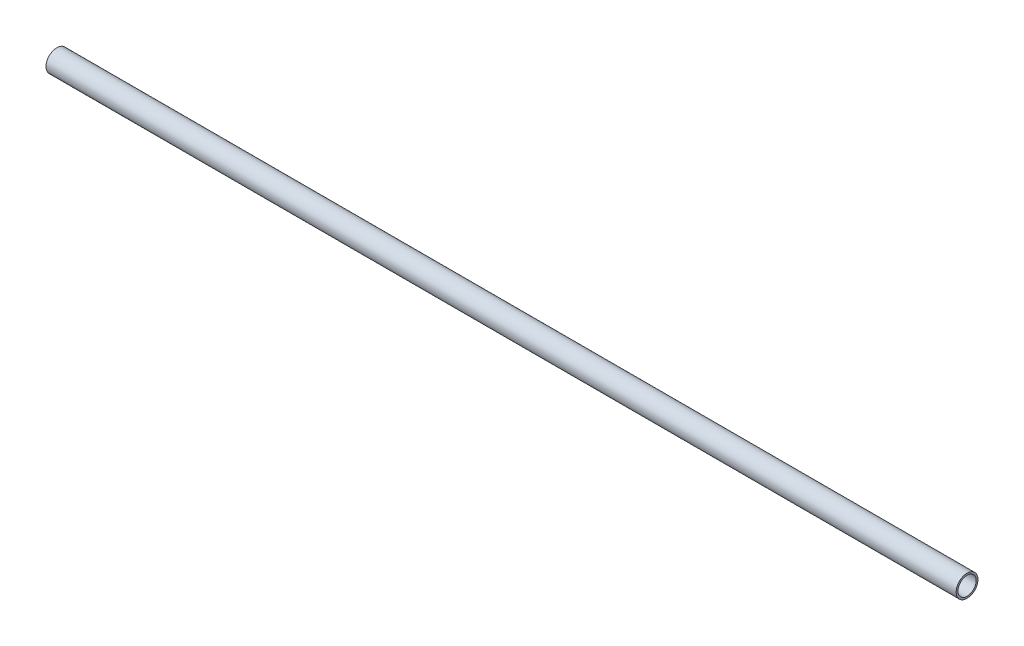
from build123d import *

# Parameters (mm, degrees)
SKETCH1_R      = 120
SKETCH1_R_2    = 100
EXTRUDE1_DEPTH = 10000


with BuildPart() as part:
    # Sketch1 → Extrude1 (new body)
    with BuildSketch(Plane(origin=(0, 0, 0), x_dir=(0, 0, -1), z_dir=(1, 0, 0))):
        Circle(SKETCH1_R)
        Circle(SKETCH1_R_2, mode=Mode.SUBTRACT)
    extrude(amount=EXTRUDE1_DEPTH)


solid = part.part
